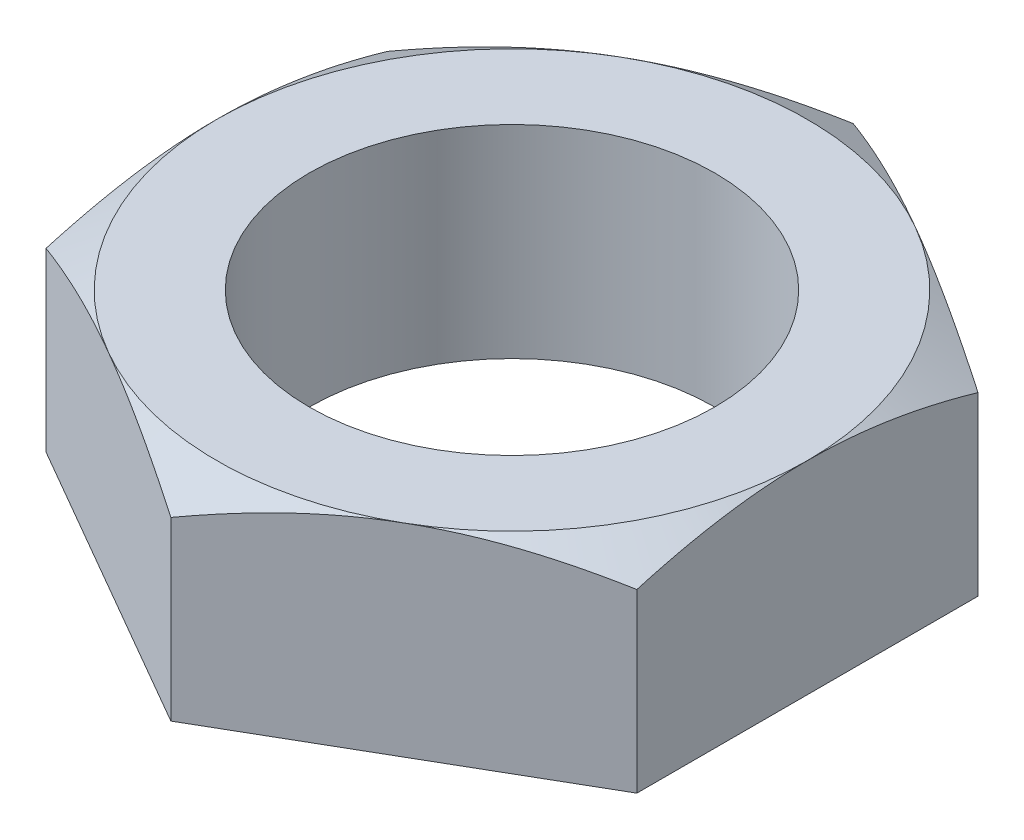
from build123d import *

# Parameters (mm, degrees)
SKETCH1_R           = 9
BOSS_EXTRUDE1_DEPTH = 9
SKETCH2_OUTSIDE_W   = 53.758
SKETCH2_OUTSIDE_H   = 57.816
SKETCH2_OUTSIDE_R   = 13.113240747
CUT_EXTRUDE1_DEPTH  = 5
CUT_EXTRUDE1_DRAFT  = -60


with BuildPart() as part:
    # Sketch1 → Boss-Extrude1 (new body)
    with BuildSketch(Plane(origin=(0, 0, 0), x_dir=(1, 0, 0), z_dir=(0, 1, 0))):
        Polygon((0, 15.141866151), (-13.113240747, 7.570933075), (-13.113240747, -7.570933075), (0, -15.141866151), (13.113240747, -7.570933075), (13.113240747, 7.570933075), align=None)
        with Locations(Location((0, 0, 0), (0, 0, 270))):
            Circle(SKETCH1_R, mode=Mode.SUBTRACT)
    extrude(amount=BOSS_EXTRUDE1_DEPTH)


with BuildPart() as cut_extrude1_tool:
    # Sketch2 outside → Cut-Extrude1 (with draft: the straight prism first)
    with BuildSketch(Plane(origin=(0, 9, 0), x_dir=(1, 0, 0), z_dir=(0, 1, 0))):
        Rectangle(SKETCH2_OUTSIDE_W, SKETCH2_OUTSIDE_H)
        Circle(SKETCH2_OUTSIDE_R, mode=Mode.SUBTRACT)
    extrude(amount=-CUT_EXTRUDE1_DEPTH)
    # Cut-Extrude1: the draft: its side faces are tilted about the plane it starts from
    cut_extrude1_sides = [cut_extrude1_tool.faces().sort_by_distance(p)[0] for p in [
        (0, 6.5, 28.908),
        (26.879, 6.5, 0),
        (0, 6.5, -28.908),
        (-26.879, 6.5, 0),
        (-13.113240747, 6.5, 0),
    ]]
    draft(cut_extrude1_sides, Plane(origin=(0, 9, 0), x_dir=(1, 0, 0), z_dir=(0, 1, 0)), CUT_EXTRUDE1_DRAFT)


with BuildPart() as part_1:
    add(part.part)

    # Cut-Extrude1: cut by cut_extrude1_tool
    add(cut_extrude1_tool.part, mode=Mode.SUBTRACT)


solid = part_1.part
